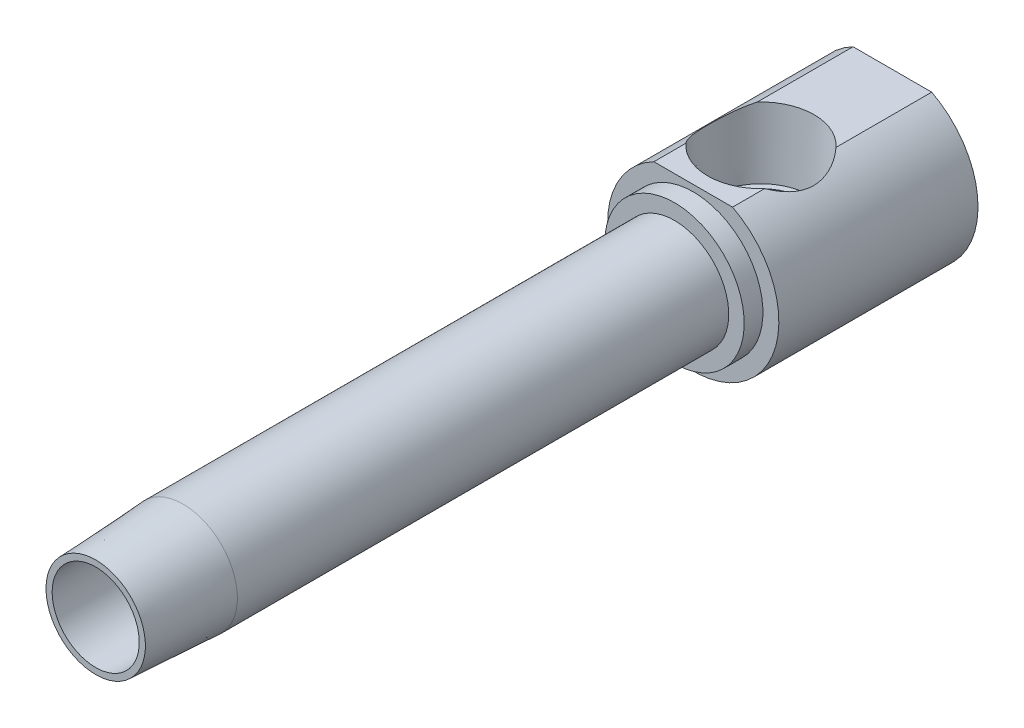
ISO-10303-21;
HEADER;
FILE_DESCRIPTION(('STEP AP214'),'2;1');
FILE_NAME('part.step','',(''),(''),'','','');
FILE_SCHEMA(('AUTOMOTIVE_DESIGN { 1 0 10303 214 1 1 1 1 }'));
ENDSEC;
DATA;
#1=APPLICATION_CONTEXT('core data for automotive mechanical design processes');
#2=APPLICATION_PROTOCOL_DEFINITION('international standard','automotive_design',2000,#1);
#3=PRODUCT_CONTEXT('',#1,'mechanical');
#4=PRODUCT('Part','Part','',(#3));
#5=PRODUCT_RELATED_PRODUCT_CATEGORY('part','',(#4));
#6=PRODUCT_DEFINITION_FORMATION('','',#4);
#7=PRODUCT_DEFINITION_CONTEXT('part definition',#1,'design');
#8=PRODUCT_DEFINITION('design','',#6,#7);
#9=PRODUCT_DEFINITION_SHAPE('','',#8);
#10=(LENGTH_UNIT() NAMED_UNIT(*) SI_UNIT(.MILLI.,.METRE.));
#11=(NAMED_UNIT(*) PLANE_ANGLE_UNIT() SI_UNIT($,.RADIAN.));
#12=(NAMED_UNIT(*) SI_UNIT($,.STERADIAN.) SOLID_ANGLE_UNIT());
#13=UNCERTAINTY_MEASURE_WITH_UNIT(LENGTH_MEASURE(1.E-05),#10,'distance_accuracy_value','');
#14=(GEOMETRIC_REPRESENTATION_CONTEXT(3) GLOBAL_UNCERTAINTY_ASSIGNED_CONTEXT((#13)) GLOBAL_UNIT_ASSIGNED_CONTEXT((#10,
#11,#12)) REPRESENTATION_CONTEXT('',''));
#15=CARTESIAN_POINT('',(0.,0.,0.));
#16=DIRECTION('',(0.,0.,1.));
#17=DIRECTION('',(1.,0.,0.));
#18=AXIS2_PLACEMENT_3D('',#15,#16,#17);
#19=CARTESIAN_POINT('',(0.,0.,-135.522166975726));
#20=DIRECTION('',(0.,0.,-1.));
#21=DIRECTION('',(-1.,0.,0.));
#22=AXIS2_PLACEMENT_3D('',#19,#20,#21);
#23=CYLINDRICAL_SURFACE('',#22,6.9215);
#24=CARTESIAN_POINT('',(0.,0.,-11.1472000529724));
#25=DIRECTION('',(0.,0.,-1.));
#26=DIRECTION('',(-1.,0.,0.));
#27=AXIS2_PLACEMENT_3D('',#24,#25,#26);
#28=CIRCLE('',#27,6.9215);
#29=CARTESIAN_POINT('',(-6.9215,0.,-11.1472000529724));
#30=VERTEX_POINT('',#29);
#31=EDGE_CURVE('E260',#30,#30,#28,.T.);
#32=ORIENTED_EDGE('',*,*,#31,.T.);
#33=EDGE_LOOP('',(#32));
#34=FACE_BOUND('',#33,.T.);
#35=CARTESIAN_POINT('',(0.,0.,-73.8124));
#36=DIRECTION('',(0.,0.,-1.));
#37=DIRECTION('',(-1.,0.,0.));
#38=AXIS2_PLACEMENT_3D('',#35,#36,#37);
#39=CIRCLE('',#38,6.9215);
#40=CARTESIAN_POINT('',(-6.9215,0.,-73.8124));
#41=VERTEX_POINT('',#40);
#42=EDGE_CURVE('E230',#41,#41,#39,.T.);
#43=ORIENTED_EDGE('',*,*,#42,.F.);
#44=EDGE_LOOP('',(#43));
#45=FACE_BOUND('',#44,.T.);
#46=ADVANCED_FACE('F15',(#34,#45),#23,.T.);
#47=CARTESIAN_POINT('',(-5.0165,9.70179425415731,-60.325));
#48=DIRECTION('',(0.,-1.,0.));
#49=DIRECTION('',(0.,0.,-1.));
#50=AXIS2_PLACEMENT_3D('',#47,#48,#49);
#51=PLANE('',#50);
#52=DIRECTION('',(0.,0.,-1.));
#53=VECTOR('',#52,1.);
#54=CARTESIAN_POINT('',(5.0165,9.70179425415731,-60.325));
#55=LINE('',#54,#53);
#56=CARTESIAN_POINT('',(5.0165,9.70179425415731,-76.2));
#57=VERTEX_POINT('',#56);
#58=CARTESIAN_POINT('',(5.0165,9.70179425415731,-80.2806639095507));
#59=VERTEX_POINT('',#58);
#60=EDGE_CURVE('E222',#57,#59,#55,.T.);
#61=ORIENTED_EDGE('',*,*,#60,.T.);
#62=CARTESIAN_POINT('',(0.,9.70179425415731,-84.836));
#63=DIRECTION('',(0.,-1.,0.));
#64=DIRECTION('',(0.,0.,-1.));
#65=AXIS2_PLACEMENT_3D('',#62,#63,#64);
#66=CIRCLE('',#65,6.77616109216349);
#67=CARTESIAN_POINT('',(-5.0165,9.70179425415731,-80.2806639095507));
#68=VERTEX_POINT('',#67);
#69=EDGE_CURVE('E10',#59,#68,#66,.T.);
#70=ORIENTED_EDGE('',*,*,#69,.T.);
#71=DIRECTION('',(0.,0.,-1.));
#72=VECTOR('',#71,1.);
#73=CARTESIAN_POINT('',(-5.0165,9.70179425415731,-60.325));
#74=LINE('',#73,#72);
#75=CARTESIAN_POINT('',(-5.0165,9.70179425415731,-76.2));
#76=VERTEX_POINT('',#75);
#77=EDGE_CURVE('E229',#76,#68,#74,.T.);
#78=ORIENTED_EDGE('',*,*,#77,.F.);
#79=DIRECTION('',(1.,0.,0.));
#80=VECTOR('',#79,1.);
#81=CARTESIAN_POINT('',(-8.89,9.70179425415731,-76.2));
#82=LINE('',#81,#80);
#83=EDGE_CURVE('E192',#76,#57,#82,.T.);
#84=ORIENTED_EDGE('',*,*,#83,.T.);
#85=EDGE_LOOP('',(#61,#70,#78,#84));
#86=FACE_BOUND('',#85,.T.);
#87=ADVANCED_FACE('F128',(#86),#51,.F.);
#88=CARTESIAN_POINT('',(-5.55625,0.,-73.787));
#89=DIRECTION('',(0.,0.,1.));
#90=DIRECTION('',(1.,0.,0.));
#91=AXIS2_PLACEMENT_3D('',#88,#89,#90);
#92=PLANE('',#91);
#93=CARTESIAN_POINT('',(0.,0.,-73.787));
#94=DIRECTION('',(0.,0.,-1.));
#95=DIRECTION('',(-1.,0.,0.));
#96=AXIS2_PLACEMENT_3D('',#93,#94,#95);
#97=CIRCLE('',#96,5.55625);
#98=CARTESIAN_POINT('',(-5.55625,0.,-73.787));
#99=VERTEX_POINT('',#98);
#100=EDGE_CURVE('E243',#99,#99,#97,.T.);
#101=ORIENTED_EDGE('',*,*,#100,.F.);
#102=EDGE_LOOP('',(#101));
#103=FACE_BOUND('',#102,.T.);
#104=CARTESIAN_POINT('',(0.,-0.00757924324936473,-73.787));
#105=DIRECTION('',(0.,0.,1.));
#106=DIRECTION('',(0.,1.,0.));
#107=AXIS2_PLACEMENT_3D('',#104,#105,#106);
#108=ELLIPSE('',#107,5.22919092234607,4.47866855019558);
#109=CARTESIAN_POINT('',(0.,5.22161167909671,-73.787));
#110=VERTEX_POINT('',#109);
#111=EDGE_CURVE('E193',#110,#110,#108,.F.);
#112=ORIENTED_EDGE('',*,*,#111,.T.);
#113=EDGE_LOOP('',(#112));
#114=FACE_BOUND('',#113,.T.);
#115=ADVANCED_FACE('F134',(#103,#114),#92,.T.);
#116=CARTESIAN_POINT('',(-5.55625,0.,0.));
#117=DIRECTION('',(0.,0.,1.));
#118=DIRECTION('',(1.,0.,0.));
#119=AXIS2_PLACEMENT_3D('',#116,#117,#118);
#120=PLANE('',#119);
#121=CARTESIAN_POINT('',(0.,0.,0.));
#122=DIRECTION('',(0.,0.,-1.));
#123=DIRECTION('',(-1.,0.,0.));
#124=AXIS2_PLACEMENT_3D('',#121,#122,#123);
#125=CIRCLE('',#124,6.3373);
#126=CARTESIAN_POINT('',(-6.3373,0.,0.));
#127=VERTEX_POINT('',#126);
#128=EDGE_CURVE('E257',#127,#127,#125,.T.);
#129=ORIENTED_EDGE('',*,*,#128,.F.);
#130=EDGE_LOOP('',(#129));
#131=FACE_BOUND('',#130,.T.);
#132=CARTESIAN_POINT('',(0.,0.,0.));
#133=DIRECTION('',(0.,0.,-1.));
#134=DIRECTION('',(-1.,0.,0.));
#135=AXIS2_PLACEMENT_3D('',#132,#133,#134);
#136=CIRCLE('',#135,5.55625);
#137=CARTESIAN_POINT('',(-5.55625,0.,0.));
#138=VERTEX_POINT('',#137);
#139=EDGE_CURVE('E19',#138,#138,#136,.T.);
#140=ORIENTED_EDGE('',*,*,#139,.T.);
#141=EDGE_LOOP('',(#140));
#142=FACE_BOUND('',#141,.T.);
#143=ADVANCED_FACE('F17',(#131,#142),#120,.T.);
#144=CARTESIAN_POINT('',(0.,0.,-135.522166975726));
#145=DIRECTION('',(0.,0.,-1.));
#146=DIRECTION('',(-1.,0.,0.));
#147=AXIS2_PLACEMENT_3D('',#144,#145,#146);
#148=CYLINDRICAL_SURFACE('',#147,5.55625);
#149=ORIENTED_EDGE('',*,*,#100,.T.);
#150=EDGE_LOOP('',(#149));
#151=FACE_BOUND('',#150,.T.);
#152=ORIENTED_EDGE('',*,*,#139,.F.);
#153=EDGE_LOOP('',(#152));
#154=FACE_BOUND('',#153,.T.);
#155=ADVANCED_FACE('F141',(#151,#154),#148,.F.);
#156=CARTESIAN_POINT('',(-10.922,0.,-101.6));
#157=DIRECTION('',(0.,0.,-1.));
#158=DIRECTION('',(-1.,0.,0.));
#159=AXIS2_PLACEMENT_3D('',#156,#157,#158);
#160=PLANE('',#159);
#161=DIRECTION('',(1.,0.,0.));
#162=VECTOR('',#161,1.);
#163=CARTESIAN_POINT('',(-2.7496306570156,4.7625,-101.6));
#164=LINE('',#163,#162);
#165=CARTESIAN_POINT('',(-2.7496306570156,4.7625,-101.6));
#166=VERTEX_POINT('',#165);
#167=CARTESIAN_POINT('',(2.7496306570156,4.7625,-101.6));
#168=VERTEX_POINT('',#167);
#169=EDGE_CURVE('E353',#166,#168,#164,.T.);
#170=ORIENTED_EDGE('',*,*,#169,.F.);
#171=DIRECTION('',(0.5,0.866025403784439,0.));
#172=VECTOR('',#171,1.);
#173=CARTESIAN_POINT('',(-5.49926131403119,0.,-101.6));
#174=LINE('',#173,#172);
#175=CARTESIAN_POINT('',(-5.49926131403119,0.,-101.6));
#176=VERTEX_POINT('',#175);
#177=EDGE_CURVE('E338',#176,#166,#174,.T.);
#178=ORIENTED_EDGE('',*,*,#177,.F.);
#179=DIRECTION('',(-0.5,0.866025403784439,0.));
#180=VECTOR('',#179,1.);
#181=CARTESIAN_POINT('',(-2.7496306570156,-4.7625,-101.6));
#182=LINE('',#181,#180);
#183=CARTESIAN_POINT('',(-2.7496306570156,-4.7625,-101.6));
#184=VERTEX_POINT('',#183);
#185=EDGE_CURVE('E342',#184,#176,#182,.T.);
#186=ORIENTED_EDGE('',*,*,#185,.F.);
#187=DIRECTION('',(-1.,0.,0.));
#188=VECTOR('',#187,1.);
#189=CARTESIAN_POINT('',(2.74963065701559,-4.7625,-101.6));
#190=LINE('',#189,#188);
#191=CARTESIAN_POINT('',(2.74963065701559,-4.7625,-101.6));
#192=VERTEX_POINT('',#191);
#193=EDGE_CURVE('E361',#192,#184,#190,.T.);
#194=ORIENTED_EDGE('',*,*,#193,.F.);
#195=DIRECTION('',(-0.5,-0.866025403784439,0.));
#196=VECTOR('',#195,1.);
#197=CARTESIAN_POINT('',(5.49926131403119,0.,-101.6));
#198=LINE('',#197,#196);
#199=CARTESIAN_POINT('',(5.49926131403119,0.,-101.6));
#200=VERTEX_POINT('',#199);
#201=EDGE_CURVE('E358',#200,#192,#198,.T.);
#202=ORIENTED_EDGE('',*,*,#201,.F.);
#203=DIRECTION('',(0.5,-0.866025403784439,0.));
#204=VECTOR('',#203,1.);
#205=CARTESIAN_POINT('',(2.7496306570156,4.7625,-101.6));
#206=LINE('',#205,#204);
#207=EDGE_CURVE('E355',#168,#200,#206,.T.);
#208=ORIENTED_EDGE('',*,*,#207,.F.);
#209=EDGE_LOOP('',(#170,#178,#186,#194,#202,#208));
#210=FACE_BOUND('',#209,.T.);
#211=DIRECTION('',(-1.,0.,0.));
#212=VECTOR('',#211,1.);
#213=CARTESIAN_POINT('',(-5.0165,9.70179425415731,-101.6));
#214=LINE('',#213,#212);
#215=CARTESIAN_POINT('',(5.0165,9.70179425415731,-101.6));
#216=VERTEX_POINT('',#215);
#217=CARTESIAN_POINT('',(-5.0165,9.70179425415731,-101.6));
#218=VERTEX_POINT('',#217);
#219=EDGE_CURVE('E223',#216,#218,#214,.T.);
#220=ORIENTED_EDGE('',*,*,#219,.F.);
#221=CARTESIAN_POINT('',(0.,0.,-101.6));
#222=DIRECTION('',(0.,0.,-1.));
#223=DIRECTION('',(-1.,0.,0.));
#224=AXIS2_PLACEMENT_3D('',#221,#222,#223);
#225=CIRCLE('',#224,10.922);
#226=EDGE_CURVE('E221',#216,#218,#225,.T.);
#227=ORIENTED_EDGE('',*,*,#226,.T.);
#228=EDGE_LOOP('',(#220,#227));
#229=FACE_BOUND('',#228,.T.);
#230=ADVANCED_FACE('F144',(#210,#229),#160,.T.);
#231=CARTESIAN_POINT('',(0.,0.,-135.522166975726));
#232=DIRECTION('',(0.,0.,-1.));
#233=DIRECTION('',(-1.,0.,0.));
#234=AXIS2_PLACEMENT_3D('',#231,#232,#233);
#235=CYLINDRICAL_SURFACE('',#234,10.922);
#236=CARTESIAN_POINT('',(5.01611318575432,9.70199425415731,-80.2802223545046));
#237=CARTESIAN_POINT('',(5.13874600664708,9.63860171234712,-80.4202157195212));
#238=CARTESIAN_POINT('',(5.25564164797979,9.57520664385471,-80.5652560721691));
#239=CARTESIAN_POINT('',(5.47752086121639,9.45002813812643,-80.8649810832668));
#240=CARTESIAN_POINT('',(5.58249714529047,9.38824570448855,-81.0196715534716));
#241=CARTESIAN_POINT('',(5.78097274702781,9.26736711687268,-81.3397255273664));
#242=CARTESIAN_POINT('',(5.87434183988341,9.20830544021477,-81.50518303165));
#243=CARTESIAN_POINT('',(6.04766375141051,9.09541327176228,-81.8446785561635));
#244=CARTESIAN_POINT('',(6.12761848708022,9.04158203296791,-82.0187153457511));
#245=CARTESIAN_POINT('',(6.27379640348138,8.94077724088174,-82.3756432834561));
#246=CARTESIAN_POINT('',(6.33993919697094,8.89384428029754,-82.5585790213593));
#247=CARTESIAN_POINT('',(6.45706504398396,8.80917858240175,-82.9312949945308));
#248=CARTESIAN_POINT('',(6.50805163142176,8.77144370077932,-83.1210736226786));
#249=CARTESIAN_POINT('',(6.59383346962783,8.70714156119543,-83.5051144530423));
#250=CARTESIAN_POINT('',(6.62870831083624,8.68051947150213,-83.6993495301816));
#251=CARTESIAN_POINT('',(6.6819385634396,8.63961377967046,-84.0913437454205));
#252=CARTESIAN_POINT('',(6.70029794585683,8.62532721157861,-84.2891020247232));
#253=CARTESIAN_POINT('',(6.71863048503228,8.61105017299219,-84.6565003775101));
#254=CARTESIAN_POINT('',(6.72092722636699,8.6092532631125,-84.8259594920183));
#255=CARTESIAN_POINT('',(6.71322085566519,8.61526418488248,-85.1644147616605));
#256=CARTESIAN_POINT('',(6.70321892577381,8.6230710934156,-85.3334109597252));
#257=CARTESIAN_POINT('',(6.67106070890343,8.64797346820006,-85.6697526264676));
#258=CARTESIAN_POINT('',(6.64888985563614,8.66508006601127,-85.8370958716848));
#259=CARTESIAN_POINT('',(6.59274566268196,8.70787088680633,-86.1686318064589));
#260=CARTESIAN_POINT('',(6.55877214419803,8.73355523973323,-86.3328244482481));
#261=CARTESIAN_POINT('',(6.44503992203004,8.8181720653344,-86.7976969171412));
#262=CARTESIAN_POINT('',(6.35112179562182,8.88662503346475,-87.0933027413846));
#263=CARTESIAN_POINT('',(6.12702756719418,9.04257250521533,-87.6648699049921));
#264=CARTESIAN_POINT('',(5.99683851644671,9.13007380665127,-87.9408241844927));
#265=CARTESIAN_POINT('',(5.73165005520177,9.2982747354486,-88.4189447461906));
#266=CARTESIAN_POINT('',(5.60244827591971,9.37701803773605,-88.6250612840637));
#267=CARTESIAN_POINT('',(5.32402625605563,9.53785679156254,-89.0208216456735));
#268=CARTESIAN_POINT('',(5.17487070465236,9.61994083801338,-89.2105155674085));
#269=CARTESIAN_POINT('',(5.01611318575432,9.70199425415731,-89.3917776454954));
#270=B_SPLINE_CURVE_WITH_KNOTS('',3,(#236,#237,#238,#239,#240,#241,#242,#243,#244,#245,#246,
#247,#248,#249,#250,#251,#252,#253,#254,#255,#256,#257,#258,#259,#260,#261,#262,#263,#264,#265,
#266,#267,#268,#269),.UNSPECIFIED.,.F.,.F.,(4,2,2,2,2,2,2,2,2,2,2,2,2,2,2,2,4),(0.,
0.589708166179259,1.17977497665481,1.77595731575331,2.372054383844,2.97152964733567,
3.57086502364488,4.16720722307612,4.76340599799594,5.27115701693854,5.77885923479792,
6.28717050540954,6.79548947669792,7.74447500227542,8.69379975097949,9.45956340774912,
10.2229020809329),.UNSPECIFIED.);
#271=CARTESIAN_POINT('',(5.0165,9.70179425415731,-89.3913360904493));
#272=VERTEX_POINT('',#271);
#273=EDGE_CURVE('E31',#59,#272,#270,.T.);
#274=ORIENTED_EDGE('',*,*,#273,.F.);
#275=ORIENTED_EDGE('',*,*,#60,.F.);
#276=CARTESIAN_POINT('',(0.,0.,-76.2));
#277=DIRECTION('',(0.,0.,-1.));
#278=DIRECTION('',(-1.,0.,0.));
#279=AXIS2_PLACEMENT_3D('',#276,#277,#278);
#280=CIRCLE('',#279,10.922);
#281=EDGE_CURVE('E239',#57,#76,#280,.T.);
#282=ORIENTED_EDGE('',*,*,#281,.T.);
#283=ORIENTED_EDGE('',*,*,#77,.T.);
#284=CARTESIAN_POINT('',(-5.01611318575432,9.70199425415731,-89.3917776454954));
#285=CARTESIAN_POINT('',(-5.13874600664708,9.63860171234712,-89.2517842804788));
#286=CARTESIAN_POINT('',(-5.25564164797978,9.57520664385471,-89.1067439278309));
#287=CARTESIAN_POINT('',(-5.47752086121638,9.45002813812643,-88.8070189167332));
#288=CARTESIAN_POINT('',(-5.58249714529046,9.38824570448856,-88.6523284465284));
#289=CARTESIAN_POINT('',(-5.78097274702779,9.2673671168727,-88.3322744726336));
#290=CARTESIAN_POINT('',(-5.87434183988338,9.20830544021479,-88.16681696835));
#291=CARTESIAN_POINT('',(-6.04766375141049,9.09541327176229,-87.8273214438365));
#292=CARTESIAN_POINT('',(-6.12761848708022,9.04158203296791,-87.653284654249));
#293=CARTESIAN_POINT('',(-6.27379640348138,8.94077724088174,-87.2963567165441));
#294=CARTESIAN_POINT('',(-6.33993919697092,8.89384428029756,-87.1134209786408));
#295=CARTESIAN_POINT('',(-6.45706504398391,8.80917858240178,-86.7407050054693));
#296=CARTESIAN_POINT('',(-6.50805163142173,8.77144370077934,-86.5509263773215));
#297=CARTESIAN_POINT('',(-6.59383346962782,8.70714156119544,-86.1668855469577));
#298=CARTESIAN_POINT('',(-6.62870831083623,8.68051947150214,-85.9726504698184));
#299=CARTESIAN_POINT('',(-6.6819385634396,8.63961377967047,-85.5806562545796));
#300=CARTESIAN_POINT('',(-6.70029794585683,8.62532721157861,-85.3828979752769));
#301=CARTESIAN_POINT('',(-6.71863048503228,8.61105017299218,-85.01549962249));
#302=CARTESIAN_POINT('',(-6.72092722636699,8.6092532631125,-84.8460405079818));
#303=CARTESIAN_POINT('',(-6.71322085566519,8.61526418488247,-84.5075852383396));
#304=CARTESIAN_POINT('',(-6.70321892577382,8.6230710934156,-84.3385890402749));
#305=CARTESIAN_POINT('',(-6.67106070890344,8.64797346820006,-84.0022473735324));
#306=CARTESIAN_POINT('',(-6.64888985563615,8.66508006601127,-83.8349041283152));
#307=CARTESIAN_POINT('',(-6.59274566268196,8.70787088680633,-83.503368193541));
#308=CARTESIAN_POINT('',(-6.55877214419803,8.73355523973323,-83.3391755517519));
#309=CARTESIAN_POINT('',(-6.44503992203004,8.8181720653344,-82.8743030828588));
#310=CARTESIAN_POINT('',(-6.35112179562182,8.88662503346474,-82.5786972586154));
#311=CARTESIAN_POINT('',(-6.12702756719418,9.04257250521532,-82.0071300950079));
#312=CARTESIAN_POINT('',(-5.99683851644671,9.13007380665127,-81.7311758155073));
#313=CARTESIAN_POINT('',(-5.73165005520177,9.2982747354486,-81.2530552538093));
#314=CARTESIAN_POINT('',(-5.60244827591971,9.37701803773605,-81.0469387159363));
#315=CARTESIAN_POINT('',(-5.32402625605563,9.53785679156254,-80.6511783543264));
#316=CARTESIAN_POINT('',(-5.17487070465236,9.61994083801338,-80.4614844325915));
#317=CARTESIAN_POINT('',(-5.01611318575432,9.70199425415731,-80.2802223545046));
#318=B_SPLINE_CURVE_WITH_KNOTS('',3,(#284,#285,#286,#287,#288,#289,#290,#291,#292,#293,#294,
#295,#296,#297,#298,#299,#300,#301,#302,#303,#304,#305,#306,#307,#308,#309,#310,#311,#312,#313,
#314,#315,#316,#317),.UNSPECIFIED.,.F.,.F.,(4,2,2,2,2,2,2,2,2,2,2,2,2,2,2,2,4),(0.,
0.589708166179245,1.17977497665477,1.77595731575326,2.3720543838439,2.97152964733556,
3.57086502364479,4.16720722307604,4.76340599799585,5.27115701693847,5.77885923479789,
6.28717050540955,6.79548947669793,7.74447500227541,8.69379975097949,9.45956340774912,
10.2229020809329),.UNSPECIFIED.);
#319=CARTESIAN_POINT('',(-5.0165,9.70179425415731,-89.3913360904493));
#320=VERTEX_POINT('',#319);
#321=EDGE_CURVE('E161',#320,#68,#318,.T.);
#322=ORIENTED_EDGE('',*,*,#321,.F.);
#323=EDGE_CURVE('E215',#320,#218,#74,.T.);
#324=ORIENTED_EDGE('',*,*,#323,.T.);
#325=ORIENTED_EDGE('',*,*,#226,.F.);
#326=EDGE_CURVE('E213',#272,#216,#55,.T.);
#327=ORIENTED_EDGE('',*,*,#326,.F.);
#328=EDGE_LOOP('',(#274,#275,#282,#283,#322,#324,#325,#327));
#329=FACE_BOUND('',#328,.T.);
#330=ADVANCED_FACE('F151',(#329),#235,.T.);
#331=CARTESIAN_POINT('',(-8.89,0.,-76.2));
#332=DIRECTION('',(0.,0.,1.));
#333=DIRECTION('',(1.,0.,0.));
#334=AXIS2_PLACEMENT_3D('',#331,#332,#333);
#335=PLANE('',#334);
#336=ORIENTED_EDGE('',*,*,#83,.F.);
#337=ORIENTED_EDGE('',*,*,#281,.F.);
#338=EDGE_LOOP('',(#336,#337));
#339=FACE_BOUND('',#338,.T.);
#340=CARTESIAN_POINT('',(0.,0.,-76.2));
#341=DIRECTION('',(0.,0.,-1.));
#342=DIRECTION('',(-1.,0.,0.));
#343=AXIS2_PLACEMENT_3D('',#340,#341,#342);
#344=CIRCLE('',#343,8.89);
#345=CARTESIAN_POINT('',(-8.89,0.,-76.2));
#346=VERTEX_POINT('',#345);
#347=EDGE_CURVE('E236',#346,#346,#344,.T.);
#348=ORIENTED_EDGE('',*,*,#347,.T.);
#349=EDGE_LOOP('',(#348));
#350=FACE_BOUND('',#349,.T.);
#351=ADVANCED_FACE('F156',(#339,#350),#335,.T.);
#352=CARTESIAN_POINT('',(0.,0.,-135.522166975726));
#353=DIRECTION('',(0.,0.,-1.));
#354=DIRECTION('',(-1.,0.,0.));
#355=AXIS2_PLACEMENT_3D('',#352,#353,#354);
#356=CYLINDRICAL_SURFACE('',#355,8.89);
#357=CARTESIAN_POINT('',(0.,0.,-73.8124));
#358=DIRECTION('',(0.,0.,-1.));
#359=DIRECTION('',(-1.,0.,0.));
#360=AXIS2_PLACEMENT_3D('',#357,#358,#359);
#361=CIRCLE('',#360,8.89);
#362=CARTESIAN_POINT('',(-8.89,0.,-73.8124));
#363=VERTEX_POINT('',#362);
#364=EDGE_CURVE('E233',#363,#363,#361,.T.);
#365=ORIENTED_EDGE('',*,*,#364,.T.);
#366=EDGE_LOOP('',(#365));
#367=FACE_BOUND('',#366,.T.);
#368=ORIENTED_EDGE('',*,*,#347,.F.);
#369=EDGE_LOOP('',(#368));
#370=FACE_BOUND('',#369,.T.);
#371=ADVANCED_FACE('F282',(#367,#370),#356,.T.);
#372=CARTESIAN_POINT('',(-6.9215,0.,-73.8124));
#373=DIRECTION('',(0.,0.,1.));
#374=DIRECTION('',(1.,0.,0.));
#375=AXIS2_PLACEMENT_3D('',#372,#373,#374);
#376=PLANE('',#375);
#377=ORIENTED_EDGE('',*,*,#42,.T.);
#378=EDGE_LOOP('',(#377));
#379=FACE_BOUND('',#378,.T.);
#380=ORIENTED_EDGE('',*,*,#364,.F.);
#381=EDGE_LOOP('',(#380));
#382=FACE_BOUND('',#381,.T.);
#383=ADVANCED_FACE('F286',(#379,#382),#376,.T.);
#384=ORIENTED_EDGE('',*,*,#323,.F.);
#385=EDGE_CURVE('E24',#320,#272,#66,.T.);
#386=ORIENTED_EDGE('',*,*,#385,.T.);
#387=ORIENTED_EDGE('',*,*,#326,.T.);
#388=ORIENTED_EDGE('',*,*,#219,.T.);
#389=EDGE_LOOP('',(#384,#386,#387,#388));
#390=FACE_BOUND('',#389,.T.);
#391=ADVANCED_FACE('F137',(#390),#51,.F.);
#392=CARTESIAN_POINT('',(-2.7496306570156,4.7625,-95.25));
#393=DIRECTION('',(0.,1.,0.));
#394=DIRECTION('',(0.,0.,1.));
#395=AXIS2_PLACEMENT_3D('',#392,#393,#394);
#396=PLANE('',#395);
#397=ORIENTED_EDGE('',*,*,#169,.T.);
#398=DIRECTION('',(0.,0.,-1.));
#399=VECTOR('',#398,1.);
#400=CARTESIAN_POINT('',(2.7496306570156,4.7625,-95.25));
#401=LINE('',#400,#399);
#402=CARTESIAN_POINT('',(2.7496306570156,4.7625,-95.25));
#403=VERTEX_POINT('',#402);
#404=EDGE_CURVE('E352',#403,#168,#401,.T.);
#405=ORIENTED_EDGE('',*,*,#404,.F.);
#406=DIRECTION('',(1.,0.,0.));
#407=VECTOR('',#406,1.);
#408=CARTESIAN_POINT('',(-2.7496306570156,4.7625,-95.25));
#409=LINE('',#408,#407);
#410=CARTESIAN_POINT('',(-2.7496306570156,4.7625,-95.25));
#411=VERTEX_POINT('',#410);
#412=EDGE_CURVE('E331',#411,#403,#409,.T.);
#413=ORIENTED_EDGE('',*,*,#412,.F.);
#414=DIRECTION('',(0.,0.,-1.));
#415=VECTOR('',#414,1.);
#416=CARTESIAN_POINT('',(-2.7496306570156,4.7625,-95.25));
#417=LINE('',#416,#415);
#418=EDGE_CURVE('E225',#411,#166,#417,.T.);
#419=ORIENTED_EDGE('',*,*,#418,.T.);
#420=EDGE_LOOP('',(#397,#405,#413,#419));
#421=FACE_BOUND('',#420,.T.);
#422=ADVANCED_FACE('F296',(#421),#396,.F.);
#423=CARTESIAN_POINT('',(-5.49926131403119,0.,-95.25));
#424=DIRECTION('',(-0.866025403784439,0.5,0.));
#425=DIRECTION('',(-0.5,-0.866025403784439,0.));
#426=AXIS2_PLACEMENT_3D('',#423,#424,#425);
#427=PLANE('',#426);
#428=ORIENTED_EDGE('',*,*,#177,.T.);
#429=ORIENTED_EDGE('',*,*,#418,.F.);
#430=DIRECTION('',(0.5,0.866025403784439,0.));
#431=VECTOR('',#430,1.);
#432=CARTESIAN_POINT('',(-5.49926131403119,0.,-95.25));
#433=LINE('',#432,#431);
#434=CARTESIAN_POINT('',(-5.49926131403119,0.,-95.25));
#435=VERTEX_POINT('',#434);
#436=EDGE_CURVE('E337',#435,#411,#433,.T.);
#437=ORIENTED_EDGE('',*,*,#436,.F.);
#438=DIRECTION('',(0.,0.,-1.));
#439=VECTOR('',#438,1.);
#440=CARTESIAN_POINT('',(-5.49926131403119,0.,-95.25));
#441=LINE('',#440,#439);
#442=EDGE_CURVE('E367',#435,#176,#441,.T.);
#443=ORIENTED_EDGE('',*,*,#442,.T.);
#444=EDGE_LOOP('',(#428,#429,#437,#443));
#445=FACE_BOUND('',#444,.T.);
#446=ADVANCED_FACE('F299',(#445),#427,.F.);
#447=CARTESIAN_POINT('',(-2.7496306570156,-4.7625,-95.25));
#448=DIRECTION('',(-0.866025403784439,-0.5,0.));
#449=DIRECTION('',(0.5,-0.866025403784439,0.));
#450=AXIS2_PLACEMENT_3D('',#447,#448,#449);
#451=PLANE('',#450);
#452=ORIENTED_EDGE('',*,*,#185,.T.);
#453=ORIENTED_EDGE('',*,*,#442,.F.);
#454=DIRECTION('',(-0.5,0.866025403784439,0.));
#455=VECTOR('',#454,1.);
#456=CARTESIAN_POINT('',(-2.7496306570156,-4.7625,-95.25));
#457=LINE('',#456,#455);
#458=CARTESIAN_POINT('',(-2.7496306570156,-4.7625,-95.25));
#459=VERTEX_POINT('',#458);
#460=EDGE_CURVE('E349',#459,#435,#457,.T.);
#461=ORIENTED_EDGE('',*,*,#460,.F.);
#462=DIRECTION('',(0.,0.,-1.));
#463=VECTOR('',#462,1.);
#464=CARTESIAN_POINT('',(-2.7496306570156,-4.7625,-95.25));
#465=LINE('',#464,#463);
#466=EDGE_CURVE('E369',#459,#184,#465,.T.);
#467=ORIENTED_EDGE('',*,*,#466,.T.);
#468=EDGE_LOOP('',(#452,#453,#461,#467));
#469=FACE_BOUND('',#468,.T.);
#470=ADVANCED_FACE('F313',(#469),#451,.F.);
#471=CARTESIAN_POINT('',(2.74963065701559,-4.7625,-95.25));
#472=DIRECTION('',(0.,-1.,0.));
#473=DIRECTION('',(1.,0.,0.));
#474=AXIS2_PLACEMENT_3D('',#471,#472,#473);
#475=PLANE('',#474);
#476=ORIENTED_EDGE('',*,*,#193,.T.);
#477=ORIENTED_EDGE('',*,*,#466,.F.);
#478=DIRECTION('',(-1.,0.,0.));
#479=VECTOR('',#478,1.);
#480=CARTESIAN_POINT('',(2.74963065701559,-4.7625,-95.25));
#481=LINE('',#480,#479);
#482=CARTESIAN_POINT('',(2.74963065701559,-4.7625,-95.25));
#483=VERTEX_POINT('',#482);
#484=EDGE_CURVE('E346',#483,#459,#481,.T.);
#485=ORIENTED_EDGE('',*,*,#484,.F.);
#486=DIRECTION('',(0.,0.,-1.));
#487=VECTOR('',#486,1.);
#488=CARTESIAN_POINT('',(2.74963065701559,-4.7625,-95.25));
#489=LINE('',#488,#487);
#490=EDGE_CURVE('E371',#483,#192,#489,.T.);
#491=ORIENTED_EDGE('',*,*,#490,.T.);
#492=EDGE_LOOP('',(#476,#477,#485,#491));
#493=FACE_BOUND('',#492,.T.);
#494=ADVANCED_FACE('F309',(#493),#475,.F.);
#495=CARTESIAN_POINT('',(5.49926131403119,0.,-95.25));
#496=DIRECTION('',(0.866025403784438,-0.5,0.));
#497=DIRECTION('',(0.5,0.866025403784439,0.));
#498=AXIS2_PLACEMENT_3D('',#495,#496,#497);
#499=PLANE('',#498);
#500=ORIENTED_EDGE('',*,*,#201,.T.);
#501=ORIENTED_EDGE('',*,*,#490,.F.);
#502=DIRECTION('',(-0.5,-0.866025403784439,0.));
#503=VECTOR('',#502,1.);
#504=CARTESIAN_POINT('',(5.49926131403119,0.,-95.25));
#505=LINE('',#504,#503);
#506=CARTESIAN_POINT('',(5.49926131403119,0.,-95.25));
#507=VERTEX_POINT('',#506);
#508=EDGE_CURVE('E339',#507,#483,#505,.T.);
#509=ORIENTED_EDGE('',*,*,#508,.F.);
#510=DIRECTION('',(0.,0.,-1.));
#511=VECTOR('',#510,1.);
#512=CARTESIAN_POINT('',(5.49926131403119,0.,-95.25));
#513=LINE('',#512,#511);
#514=EDGE_CURVE('E373',#507,#200,#513,.T.);
#515=ORIENTED_EDGE('',*,*,#514,.T.);
#516=EDGE_LOOP('',(#500,#501,#509,#515));
#517=FACE_BOUND('',#516,.T.);
#518=ADVANCED_FACE('F305',(#517),#499,.F.);
#519=CARTESIAN_POINT('',(2.7496306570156,4.7625,-95.25));
#520=DIRECTION('',(0.866025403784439,0.5,0.));
#521=DIRECTION('',(-0.5,0.866025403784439,0.));
#522=AXIS2_PLACEMENT_3D('',#519,#520,#521);
#523=PLANE('',#522);
#524=ORIENTED_EDGE('',*,*,#207,.T.);
#525=ORIENTED_EDGE('',*,*,#514,.F.);
#526=DIRECTION('',(0.5,-0.866025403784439,0.));
#527=VECTOR('',#526,1.);
#528=CARTESIAN_POINT('',(2.7496306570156,4.7625,-95.25));
#529=LINE('',#528,#527);
#530=EDGE_CURVE('E334',#403,#507,#529,.T.);
#531=ORIENTED_EDGE('',*,*,#530,.F.);
#532=ORIENTED_EDGE('',*,*,#404,.T.);
#533=EDGE_LOOP('',(#524,#525,#531,#532));
#534=FACE_BOUND('',#533,.T.);
#535=ADVANCED_FACE('F301',(#534),#523,.F.);
#536=CARTESIAN_POINT('',(0.,0.,-95.25));
#537=DIRECTION('',(0.,0.,-1.));
#538=DIRECTION('',(-1.,0.,0.));
#539=AXIS2_PLACEMENT_3D('',#536,#537,#538);
#540=PLANE('',#539);
#541=ORIENTED_EDGE('',*,*,#412,.T.);
#542=ORIENTED_EDGE('',*,*,#530,.T.);
#543=ORIENTED_EDGE('',*,*,#508,.T.);
#544=ORIENTED_EDGE('',*,*,#484,.T.);
#545=ORIENTED_EDGE('',*,*,#460,.T.);
#546=ORIENTED_EDGE('',*,*,#436,.T.);
#547=EDGE_LOOP('',(#541,#542,#543,#544,#545,#546));
#548=FACE_BOUND('',#547,.T.);
#549=ADVANCED_FACE('F304',(#548),#540,.T.);
#550=CARTESIAN_POINT('',(0.,-6.20347480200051,-83.170096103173));
#551=DIRECTION('',(0.,0.499512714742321,0.866306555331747));
#552=DIRECTION('',(0.,-0.866306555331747,0.499512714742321));
#553=AXIS2_PLACEMENT_3D('',#550,#551,#552);
#554=CONICAL_SURFACE('',#553,1.6057813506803,1.04663497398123);
#555=CARTESIAN_POINT('',(-1.60598135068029,-4.92366652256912,-83.5924837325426));
#556=CARTESIAN_POINT('',(-1.54801586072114,-4.95680342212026,-83.6114056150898));
#557=CARTESIAN_POINT('',(-1.48993744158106,-4.98980230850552,-83.630231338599));
#558=CARTESIAN_POINT('',(-1.37340604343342,-5.05537021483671,-83.6675949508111));
#559=CARTESIAN_POINT('',(-1.31495289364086,-5.08793901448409,-83.6861326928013));
#560=CARTESIAN_POINT('',(-1.19585116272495,-5.15341039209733,-83.7233462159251));
#561=CARTESIAN_POINT('',(-1.13518864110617,-5.18629452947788,-83.7420099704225));
#562=CARTESIAN_POINT('',(-1.01316854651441,-5.25107049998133,-83.7787085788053));
#563=CARTESIAN_POINT('',(-0.951811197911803,-5.28296264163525,-83.7967436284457));
#564=CARTESIAN_POINT('',(-0.83911893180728,-5.3396112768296,-83.8287077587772));
#565=CARTESIAN_POINT('',(-0.787957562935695,-5.36462261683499,-83.8427936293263));
#566=CARTESIAN_POINT('',(-0.68462366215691,-5.41302356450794,-83.8699938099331));
#567=CARTESIAN_POINT('',(-0.63245142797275,-5.43641364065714,-83.8831084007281));
#568=CARTESIAN_POINT('',(-0.527211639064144,-5.48038053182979,-83.9077010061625));
#569=CARTESIAN_POINT('',(-0.474159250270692,-5.50098432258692,-83.9191947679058));
#570=CARTESIAN_POINT('',(-0.36615294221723,-5.53798897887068,-83.9397880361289));
#571=CARTESIAN_POINT('',(-0.311202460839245,-5.55439703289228,-83.94889163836));
#572=CARTESIAN_POINT('',(-0.224404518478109,-5.57453509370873,-83.9600449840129));
#573=CARTESIAN_POINT('',(-0.193292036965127,-5.58064728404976,-83.9634253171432));
#574=CARTESIAN_POINT('',(-0.130548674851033,-5.59030484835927,-83.9687629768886));
#575=CARTESIAN_POINT('',(-0.0989180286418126,-5.59385135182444,-83.9707209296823));
#576=CARTESIAN_POINT('',(-0.0355632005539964,-5.59800285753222,-83.9730125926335));
#577=CARTESIAN_POINT('',(-0.0038403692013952,-5.59862312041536,-83.9733547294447));
#578=CARTESIAN_POINT('',(0.0594996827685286,-5.59689784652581,-83.9724026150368));
#579=CARTESIAN_POINT('',(0.0911168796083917,-5.59455168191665,-83.9711080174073));
#580=CARTESIAN_POINT('',(0.19883789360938,-5.58181842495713,-83.9640746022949));
#581=CARTESIAN_POINT('',(0.273911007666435,-5.56473069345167,-83.9546279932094));
#582=CARTESIAN_POINT('',(0.384150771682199,-5.53190562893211,-83.9364021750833));
#583=CARTESIAN_POINT('',(0.420888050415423,-5.51959035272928,-83.9295534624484));
#584=CARTESIAN_POINT('',(0.493546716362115,-5.49323102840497,-83.9148668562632));
#585=CARTESIAN_POINT('',(0.529468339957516,-5.47918748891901,-83.9070292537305));
#586=CARTESIAN_POINT('',(0.612782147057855,-5.44486829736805,-83.8878416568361));
#587=CARTESIAN_POINT('',(0.659900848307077,-5.42410253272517,-83.8762064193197));
#588=CARTESIAN_POINT('',(0.753260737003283,-5.38113317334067,-83.8520791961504));
#589=CARTESIAN_POINT('',(0.799501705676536,-5.35892922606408,-83.8395870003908));
#590=CARTESIAN_POINT('',(0.937391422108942,-5.29083562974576,-83.8012074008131));
#591=CARTESIAN_POINT('',(1.02808532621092,-5.24351779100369,-83.774446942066));
#592=CARTESIAN_POINT('',(1.20042119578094,-5.15111024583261,-83.72204965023));
#593=CARTESIAN_POINT('',(1.28217710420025,-5.10617320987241,-83.6965107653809));
#594=CARTESIAN_POINT('',(1.4041288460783,-5.03811359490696,-83.6577633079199));
#595=CARTESIAN_POINT('',(1.44460336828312,-5.01535392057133,-83.6447947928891));
#596=CARTESIAN_POINT('',(1.52539869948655,-4.96964276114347,-83.6187288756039));
#597=CARTESIAN_POINT('',(1.56571951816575,-4.94669128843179,-83.6056314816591));
#598=CARTESIAN_POINT('',(1.60598135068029,-4.92366652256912,-83.5924837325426));
#599=B_SPLINE_CURVE_WITH_KNOTS('',3,(#555,#556,#557,#558,#559,#560,#561,#562,#563,#564,#565,
#566,#567,#568,#569,#570,#571,#572,#573,#574,#575,#576,#577,#578,#579,#580,#581,#582,#583,#584,
#585,#586,#587,#588,#589,#590,#591,#592,#593,#594,#595,#596,#597,#598),.UNSPECIFIED.,.F.,.F.,(4,
2,2,2,2,2,2,2,2,2,2,2,2,2,2,2,2,2,2,2,2,4),(0.,0.208197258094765,0.416497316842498,
0.630934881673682,0.845305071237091,1.02127406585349,1.19719199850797,1.37126163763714,
1.54503101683,1.64057868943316,1.7360842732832,1.83109123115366,1.92611830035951,
2.15701869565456,2.27506343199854,2.3930735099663,2.55139683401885,2.70975911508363,
3.02689190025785,3.31705802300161,3.46169224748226,3.60631720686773),.UNSPECIFIED.);
#600=CARTESIAN_POINT('',(-1.11098322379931,-5.19906341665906,-83.7492401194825));
#601=VERTEX_POINT('',#600);
#602=CARTESIAN_POINT('',(1.11098322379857,-5.19906341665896,-83.7492401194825));
#603=VERTEX_POINT('',#602);
#604=EDGE_CURVE('E269',#601,#603,#599,.T.);
#605=ORIENTED_EDGE('',*,*,#604,.F.);
#606=CARTESIAN_POINT('',(0.,-6.20347480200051,-83.170096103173));
#607=DIRECTION('',(0.,-0.499512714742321,-0.866306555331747));
#608=DIRECTION('',(0.,0.866306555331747,-0.499512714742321));
#609=AXIS2_PLACEMENT_3D('',#606,#607,#608);
#610=CIRCLE('',#609,1.6057813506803);
#611=EDGE_CURVE('E172',#603,#601,#610,.T.);
#612=ORIENTED_EDGE('',*,*,#611,.F.);
#613=EDGE_LOOP('',(#605,#612));
#614=FACE_BOUND('',#613,.T.);
#615=CARTESIAN_POINT('',(0.,-6.66717404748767,-83.9742912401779));
#616=VERTEX_POINT('',#615);
#617=VERTEX_LOOP('',#616);
#618=FACE_BOUND('',#617,.T.);
#619=ADVANCED_FACE('F123',(#614,#618),#554,.F.);
#620=CARTESIAN_POINT('',(0.,0.737834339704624,-71.1317606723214));
#621=DIRECTION('',(0.,0.499512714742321,0.866306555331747));
#622=DIRECTION('',(0.,-0.866306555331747,0.499512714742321));
#623=AXIS2_PLACEMENT_3D('',#620,#621,#622);
#624=CONICAL_SURFACE('',#623,5.22642714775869,0.254883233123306);
#625=CARTESIAN_POINT('',(1.01196113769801,-5.32825795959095,-83.9724043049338));
#626=CARTESIAN_POINT('',(1.03389680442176,-5.30065791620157,-83.9244787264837));
#627=CARTESIAN_POINT('',(1.05540462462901,-5.2728973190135,-83.8764528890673));
#628=CARTESIAN_POINT('',(1.09769940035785,-5.21711231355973,-83.7802409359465));
#629=CARTESIAN_POINT('',(1.11848639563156,-5.18908791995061,-83.7320548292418));
#630=CARTESIAN_POINT('',(1.1799640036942,-5.10471123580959,-83.58732712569));
#631=CARTESIAN_POINT('',(1.21977960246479,-5.04804474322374,-83.4905976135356));
#632=CARTESIAN_POINT('',(1.29773817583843,-4.93416916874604,-83.2968471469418));
#633=CARTESIAN_POINT('',(1.33588180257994,-4.87696030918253,-83.199826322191));
#634=CARTESIAN_POINT('',(1.41092804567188,-4.76213227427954,-83.0055403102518));
#635=CARTESIAN_POINT('',(1.44783058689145,-4.70451307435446,-82.9082751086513));
#636=CARTESIAN_POINT('',(1.57544445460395,-4.50218372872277,-82.5672894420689));
#637=CARTESIAN_POINT('',(1.66369168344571,-4.3567012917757,-82.3231071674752));
#638=CARTESIAN_POINT('',(1.83681407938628,-4.06477004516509,-81.834128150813));
#639=CARTESIAN_POINT('',(1.92168912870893,-3.91832120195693,-81.5893313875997));
#640=CARTESIAN_POINT('',(2.08932287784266,-3.624688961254,-81.0991002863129));
#641=CARTESIAN_POINT('',(2.17207941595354,-3.47750498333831,-80.8536655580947));
#642=CARTESIAN_POINT('',(2.33601111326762,-3.18275206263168,-80.3625426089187));
#643=CARTESIAN_POINT('',(2.41718646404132,-3.03518316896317,-80.1168544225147));
#644=CARTESIAN_POINT('',(2.4978920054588,-2.88750711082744,-79.8710816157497));
#645=B_SPLINE_CURVE_WITH_KNOTS('',3,(#625,#626,#627,#628,#629,#630,#631,#632,#633,#634,#635,
#636,#637,#638,#639,#640,#641,#642,#643,#644),.UNSPECIFIED.,.F.,.F.,(4,2,2,2,2,2,2,2,2,4),(0.,
0.178483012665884,0.356956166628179,0.713833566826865,1.07057050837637,1.42732900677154,
2.32014264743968,3.21298744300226,4.10670963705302,5.00032286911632),.UNSPECIFIED.);
#646=CARTESIAN_POINT('',(2.49778278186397,-2.88770711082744,-79.8714144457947));
#647=VERTEX_POINT('',#646);
#648=EDGE_CURVE('E205',#603,#647,#645,.T.);
#649=ORIENTED_EDGE('',*,*,#648,.F.);
#650=ORIENTED_EDGE('',*,*,#611,.T.);
#651=CARTESIAN_POINT('',(-2.49789200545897,-2.88750711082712,-79.8710816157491));
#652=CARTESIAN_POINT('',(-2.44770652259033,-2.97939053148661,-80.0239913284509));
#653=CARTESIAN_POINT('',(-2.39731483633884,-3.07122429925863,-80.1768636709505));
#654=CARTESIAN_POINT('',(-2.29600007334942,-3.2547604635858,-80.4825157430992));
#655=CARTESIAN_POINT('',(-2.24507698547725,-3.34646285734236,-80.6352954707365));
#656=CARTESIAN_POINT('',(-2.14254206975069,-3.52977268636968,-80.9408586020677));
#657=CARTESIAN_POINT('',(-2.09092972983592,-3.62137998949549,-81.0936419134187));
#658=CARTESIAN_POINT('',(-1.98688424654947,-3.80437404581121,-81.3990585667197));
#659=CARTESIAN_POINT('',(-1.93445111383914,-3.89576080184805,-81.5516919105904));
#660=CARTESIAN_POINT('',(-1.82863256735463,-4.07804970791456,-81.8564497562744));
#661=CARTESIAN_POINT('',(-1.77524935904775,-4.16895247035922,-82.0085746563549));
#662=CARTESIAN_POINT('',(-1.66707377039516,-4.35034813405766,-82.312567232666));
#663=CARTESIAN_POINT('',(-1.61228140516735,-4.44084103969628,-82.4644349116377));
#664=CARTESIAN_POINT('',(-1.50075171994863,-4.62119778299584,-82.7677597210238));
#665=CARTESIAN_POINT('',(-1.44401501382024,-4.71106180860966,-82.9192169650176));
#666=CARTESIAN_POINT('',(-1.32768795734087,-4.88985939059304,-83.2215806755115));
#667=CARTESIAN_POINT('',(-1.26809785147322,-4.97879302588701,-83.372487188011));
#668=CARTESIAN_POINT('',(-1.19073480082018,-5.08895406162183,-83.5605249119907));
#669=CARTESIAN_POINT('',(-1.1751187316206,-5.11093553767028,-83.5981019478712));
#670=CARTESIAN_POINT('',(-1.14355086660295,-5.15477909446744,-83.6731852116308));
#671=CARTESIAN_POINT('',(-1.1275990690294,-5.17664117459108,-83.7106914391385));
#672=CARTESIAN_POINT('',(-1.07914810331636,-5.24202332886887,-83.8230974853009));
#673=CARTESIAN_POINT('',(-1.04606024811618,-5.28532942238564,-83.8978677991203));
#674=CARTESIAN_POINT('',(-1.01196113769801,-5.32825795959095,-83.9724043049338));
#675=B_SPLINE_CURVE_WITH_KNOTS('',3,(#651,#652,#653,#654,#655,#656,#657,#658,#659,#660,#661,
#662,#663,#664,#665,#666,#667,#668,#669,#670,#671,#672,#673,#674),.UNSPECIFIED.,.F.,.F.,(4,2,2,
2,2,2,2,2,2,2,2,4),(0.,0.555952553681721,1.11191677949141,1.66831997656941,2.22471595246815,
2.77995563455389,3.33518936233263,3.89024937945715,4.4452619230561,4.58401142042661,
4.7227616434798,5.00032427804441),.UNSPECIFIED.);
#676=CARTESIAN_POINT('',(-2.49778278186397,-2.88770711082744,-79.8714144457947));
#677=VERTEX_POINT('',#676);
#678=EDGE_CURVE('E191',#677,#601,#675,.T.);
#679=ORIENTED_EDGE('',*,*,#678,.F.);
#680=CARTESIAN_POINT('',(2.49782755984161,-2.88790711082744,-79.8714369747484));
#681=CARTESIAN_POINT('',(2.48383641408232,-2.82542266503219,-79.86439882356));
#682=CARTESIAN_POINT('',(2.46861957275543,-2.76328396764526,-79.8568154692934));
#683=CARTESIAN_POINT('',(2.43577104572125,-2.63978050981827,-79.8406636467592));
#684=CARTESIAN_POINT('',(2.41813947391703,-2.57841571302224,-79.8320952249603));
#685=CARTESIAN_POINT('',(2.36163791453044,-2.3954759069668,-79.8050512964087));
#686=CARTESIAN_POINT('',(2.3191890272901,-2.27517998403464,-79.7852515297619));
#687=CARTESIAN_POINT('',(2.22428392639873,-2.03745974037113,-79.7427370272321));
#688=CARTESIAN_POINT('',(2.17171615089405,-1.92008566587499,-79.7199908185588));
#689=CARTESIAN_POINT('',(2.05670473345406,-1.69074876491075,-79.6726818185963));
#690=CARTESIAN_POINT('',(1.99426748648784,-1.57878249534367,-79.6481202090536));
#691=CARTESIAN_POINT('',(1.8397697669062,-1.3305945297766,-79.5910130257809));
#692=CARTESIAN_POINT('',(1.74433104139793,-1.19650697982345,-79.5581798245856));
#693=CARTESIAN_POINT('',(1.53495715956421,-0.943799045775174,-79.493538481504));
#694=CARTESIAN_POINT('',(1.42109065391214,-0.825124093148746,-79.4617270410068));
#695=CARTESIAN_POINT('',(1.20807079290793,-0.640011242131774,-79.4106003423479));
#696=CARTESIAN_POINT('',(1.113797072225,-0.568272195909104,-79.3902880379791));
#697=CARTESIAN_POINT('',(0.914761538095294,-0.439859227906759,-79.3533514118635));
#698=CARTESIAN_POINT('',(0.810014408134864,-0.383164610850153,-79.3367220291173));
#699=CARTESIAN_POINT('',(0.612541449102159,-0.298431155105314,-79.3116257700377));
#700=CARTESIAN_POINT('',(0.521420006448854,-0.26696819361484,-79.3022015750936));
#701=CARTESIAN_POINT('',(0.334956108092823,-0.219077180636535,-79.2877979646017));
#702=CARTESIAN_POINT('',(0.239617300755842,-0.202636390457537,-79.2828147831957));
#703=CARTESIAN_POINT('',(0.0470109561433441,-0.186228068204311,-79.2778415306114));
#704=CARTESIAN_POINT('',(-0.0502624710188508,-0.18632251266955,-79.2778702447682));
#705=CARTESIAN_POINT('',(-0.243227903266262,-0.203132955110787,-79.2829652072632));
#706=CARTESIAN_POINT('',(-0.33891935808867,-0.219854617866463,-79.2880331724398));
#707=CARTESIAN_POINT('',(-0.521251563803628,-0.267164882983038,-79.3022593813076));
#708=CARTESIAN_POINT('',(-0.608105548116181,-0.297016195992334,-79.3111998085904));
#709=CARTESIAN_POINT('',(-0.776430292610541,-0.368311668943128,-79.3323290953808));
#710=CARTESIAN_POINT('',(-0.85789929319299,-0.40975959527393,-79.3445190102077));
#711=CARTESIAN_POINT('',(-1.05967586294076,-0.528631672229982,-79.3790061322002));
#712=CARTESIAN_POINT('',(-1.17553777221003,-0.6130718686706,-79.4030959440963));
#713=CARTESIAN_POINT('',(-1.39218142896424,-0.798819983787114,-79.454518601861));
#714=CARTESIAN_POINT('',(-1.49291384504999,-0.900180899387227,-79.4818615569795));
#715=CARTESIAN_POINT('',(-1.65718256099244,-1.08871747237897,-79.5307955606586));
#716=CARTESIAN_POINT('',(-1.72379796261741,-1.17332105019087,-79.5521624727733));
#717=CARTESIAN_POINT('',(-1.84937081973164,-1.34811375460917,-79.5947922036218));
#718=CARTESIAN_POINT('',(-1.90832390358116,-1.43830602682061,-79.6160549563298));
#719=CARTESIAN_POINT('',(-2.01897203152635,-1.62326479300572,-79.6578461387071));
#720=CARTESIAN_POINT('',(-2.07066203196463,-1.71803440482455,-79.6783740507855));
#721=CARTESIAN_POINT('',(-2.16700410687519,-1.9112905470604,-79.7181065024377));
#722=CARTESIAN_POINT('',(-2.21165858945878,-2.00977579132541,-79.7373114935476));
#723=CARTESIAN_POINT('',(-2.30465900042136,-2.2355271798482,-79.778551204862));
#724=CARTESIAN_POINT('',(-2.35102978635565,-2.36371403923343,-79.8000540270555));
#725=CARTESIAN_POINT('',(-2.41232360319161,-2.55862165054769,-79.8292816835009));
#726=CARTESIAN_POINT('',(-2.4313408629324,-2.62386400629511,-79.8385006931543));
#727=CARTESIAN_POINT('',(-2.46664427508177,-2.7552417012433,-79.8558314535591));
#728=CARTESIAN_POINT('',(-2.48292991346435,-2.82137720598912,-79.8639429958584));
#729=CARTESIAN_POINT('',(-2.49782755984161,-2.88790711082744,-79.8714369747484));
#730=B_SPLINE_CURVE_WITH_KNOTS('',3,(#680,#681,#682,#683,#684,#685,#686,#687,#688,#689,#690,
#691,#692,#693,#694,#695,#696,#697,#698,#699,#700,#701,#702,#703,#704,#705,#706,#707,#708,#709,
#710,#711,#712,#713,#714,#715,#716,#717,#718,#719,#720,#721,#722,#723,#724,#725,#726,#727,#728,
#729),.UNSPECIFIED.,.F.,.F.,(4,2,2,2,2,2,2,2,2,2,2,2,2,2,2,2,2,2,2,2,2,2,2,2,4),(0.,
0.193219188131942,0.386429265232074,0.773233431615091,1.16457552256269,1.55566507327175,
2.05774384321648,2.55799349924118,2.91743960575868,3.27638866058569,3.5657736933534,
3.85491310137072,4.14513627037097,4.43545835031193,4.71122438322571,4.9870800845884,
5.42075552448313,5.85581566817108,6.18473767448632,6.51384652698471,6.84318280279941,
7.17240610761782,7.58580190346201,7.79148391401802,7.99720458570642),.UNSPECIFIED.);
#731=EDGE_CURVE('E185',#647,#677,#730,.T.);
#732=ORIENTED_EDGE('',*,*,#731,.F.);
#733=EDGE_LOOP('',(#649,#650,#679,#732));
#734=FACE_BOUND('',#733,.T.);
#735=ORIENTED_EDGE('',*,*,#111,.F.);
#736=EDGE_LOOP('',(#735));
#737=FACE_BOUND('',#736,.T.);
#738=ADVANCED_FACE('F112',(#734,#737),#624,.F.);
#739=CARTESIAN_POINT('',(0.,-6.09634277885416,-84.836));
#740=DIRECTION('',(0.,1.,0.));
#741=DIRECTION('',(0.,0.,1.));
#742=AXIS2_PLACEMENT_3D('',#739,#740,#741);
#743=CONICAL_SURFACE('',#742,0.,1.0471975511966);
#744=ORIENTED_EDGE('',*,*,#648,.T.);
#745=CARTESIAN_POINT('',(0.,-2.88770711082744,-84.836));
#746=DIRECTION('',(0.,-1.,0.));
#747=DIRECTION('',(0.,0.,-1.));
#748=AXIS2_PLACEMENT_3D('',#745,#746,#747);
#749=CIRCLE('',#748,5.55752);
#750=EDGE_CURVE('E38',#677,#647,#749,.T.);
#751=ORIENTED_EDGE('',*,*,#750,.F.);
#752=ORIENTED_EDGE('',*,*,#678,.T.);
#753=ORIENTED_EDGE('',*,*,#604,.T.);
#754=EDGE_LOOP('',(#744,#751,#752,#753));
#755=FACE_BOUND('',#754,.T.);
#756=CARTESIAN_POINT('',(0.,-6.09634277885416,-84.836));
#757=VERTEX_POINT('',#756);
#758=VERTEX_LOOP('',#757);
#759=FACE_BOUND('',#758,.T.);
#760=ADVANCED_FACE('F109',(#755,#759),#743,.F.);
#761=CARTESIAN_POINT('',(0.,9.70179425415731,-84.836));
#762=DIRECTION('',(0.,-1.,0.));
#763=DIRECTION('',(0.,0.,-1.));
#764=AXIS2_PLACEMENT_3D('',#761,#762,#763);
#765=CYLINDRICAL_SURFACE('',#764,5.55752);
#766=ORIENTED_EDGE('',*,*,#731,.T.);
#767=ORIENTED_EDGE('',*,*,#750,.T.);
#768=EDGE_LOOP('',(#766,#767));
#769=FACE_BOUND('',#768,.T.);
#770=CARTESIAN_POINT('',(0.,0.990599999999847,-84.836));
#771=DIRECTION('',(0.,-1.,0.));
#772=DIRECTION('',(0.,0.,-1.));
#773=AXIS2_PLACEMENT_3D('',#770,#771,#772);
#774=CIRCLE('',#773,5.55752);
#775=CARTESIAN_POINT('',(0.,0.990599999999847,-90.39352));
#776=VERTEX_POINT('',#775);
#777=EDGE_CURVE('E263',#776,#776,#774,.T.);
#778=ORIENTED_EDGE('',*,*,#777,.F.);
#779=EDGE_LOOP('',(#778));
#780=FACE_BOUND('',#779,.T.);
#781=ADVANCED_FACE('F111',(#769,#780),#765,.F.);
#782=CARTESIAN_POINT('',(0.,0.990599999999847,-91.1548200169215));
#783=DIRECTION('',(0.,-1.,0.));
#784=DIRECTION('',(0.,0.,-1.));
#785=AXIS2_PLACEMENT_3D('',#782,#783,#784);
#786=PLANE('',#785);
#787=CARTESIAN_POINT('',(0.,0.990599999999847,-84.836));
#788=DIRECTION('',(0.,-1.,0.));
#789=DIRECTION('',(0.,0.,-1.));
#790=AXIS2_PLACEMENT_3D('',#787,#788,#789);
#791=CIRCLE('',#790,6.31882001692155);
#792=CARTESIAN_POINT('',(0.,0.990599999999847,-91.1548200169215));
#793=VERTEX_POINT('',#792);
#794=EDGE_CURVE('E259',#793,#793,#791,.T.);
#795=ORIENTED_EDGE('',*,*,#794,.F.);
#796=EDGE_LOOP('',(#795));
#797=FACE_BOUND('',#796,.T.);
#798=ORIENTED_EDGE('',*,*,#777,.T.);
#799=EDGE_LOOP('',(#798));
#800=FACE_BOUND('',#799,.T.);
#801=ADVANCED_FACE('F121',(#797,#800),#786,.F.);
#802=CARTESIAN_POINT('',(0.,0.990599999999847,-84.836));
#803=DIRECTION('',(0.,1.,0.));
#804=DIRECTION('',(0.,0.,1.));
#805=AXIS2_PLACEMENT_3D('',#802,#803,#804);
#806=CONICAL_SURFACE('',#805,6.31882001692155,0.0524522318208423);
#807=ORIENTED_EDGE('',*,*,#273,.T.);
#808=ORIENTED_EDGE('',*,*,#385,.F.);
#809=ORIENTED_EDGE('',*,*,#321,.T.);
#810=ORIENTED_EDGE('',*,*,#69,.F.);
#811=EDGE_LOOP('',(#807,#808,#809,#810));
#812=FACE_BOUND('',#811,.T.);
#813=ORIENTED_EDGE('',*,*,#794,.T.);
#814=EDGE_LOOP('',(#813));
#815=FACE_BOUND('',#814,.T.);
#816=ADVANCED_FACE('F174',(#812,#815),#806,.F.);
#817=CARTESIAN_POINT('',(0.,0.,0.));
#818=DIRECTION('',(0.,0.,-1.));
#819=DIRECTION('',(-1.,0.,0.));
#820=AXIS2_PLACEMENT_3D('',#817,#818,#819);
#821=CONICAL_SURFACE('',#820,6.3373,0.0523598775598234);
#822=ORIENTED_EDGE('',*,*,#31,.F.);
#823=EDGE_LOOP('',(#822));
#824=FACE_BOUND('',#823,.T.);
#825=ORIENTED_EDGE('',*,*,#128,.T.);
#826=EDGE_LOOP('',(#825));
#827=FACE_BOUND('',#826,.T.);
#828=ADVANCED_FACE('F179',(#824,#827),#821,.T.);
#829=CLOSED_SHELL('',(#46,#87,#115,#143,#155,#230,#330,#351,#371,#383,#391,#422,#446,#470,#494,
#518,#535,#549,#619,#738,#760,#781,#801,#816,#828));
#830=MANIFOLD_SOLID_BREP('B1',#829);
#831=ADVANCED_BREP_SHAPE_REPRESENTATION('',(#18,#830),#14);
#832=SHAPE_DEFINITION_REPRESENTATION(#9,#831);
ENDSEC;
END-ISO-10303-21;
